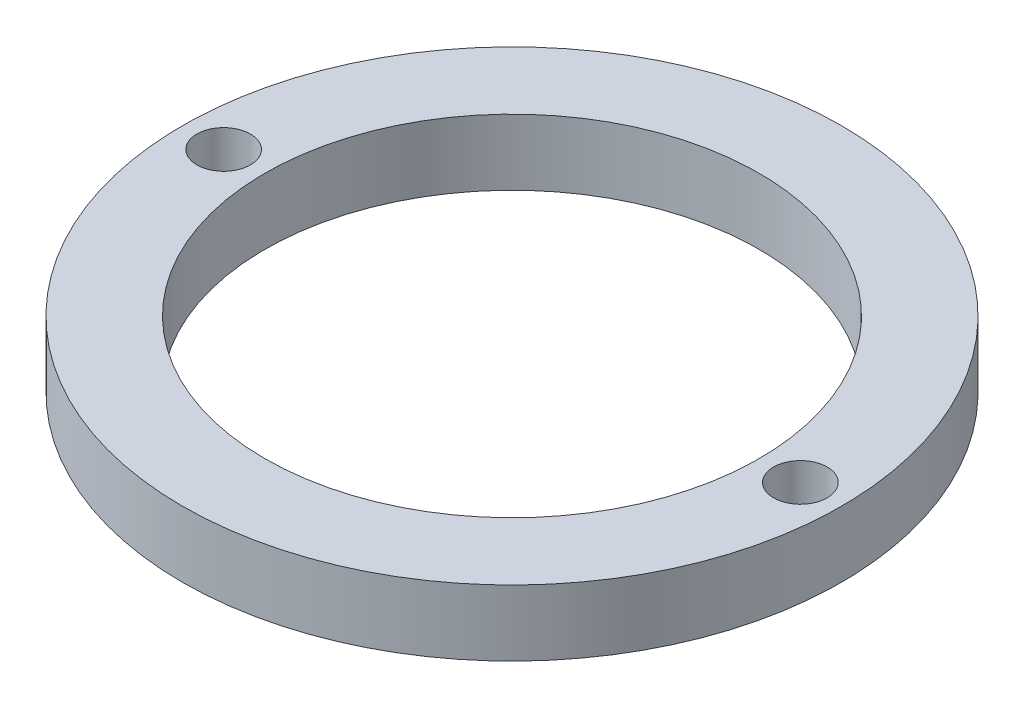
ISO-10303-21;
HEADER;
FILE_DESCRIPTION(('STEP AP214'),'2;1');
FILE_NAME('part.step','',(''),(''),'','','');
FILE_SCHEMA(('AUTOMOTIVE_DESIGN { 1 0 10303 214 1 1 1 1 }'));
ENDSEC;
DATA;
#1=APPLICATION_CONTEXT('core data for automotive mechanical design processes');
#2=APPLICATION_PROTOCOL_DEFINITION('international standard','automotive_design',2000,#1);
#3=PRODUCT_CONTEXT('',#1,'mechanical');
#4=PRODUCT('Part','Part','',(#3));
#5=PRODUCT_RELATED_PRODUCT_CATEGORY('part','',(#4));
#6=PRODUCT_DEFINITION_FORMATION('','',#4);
#7=PRODUCT_DEFINITION_CONTEXT('part definition',#1,'design');
#8=PRODUCT_DEFINITION('design','',#6,#7);
#9=PRODUCT_DEFINITION_SHAPE('','',#8);
#10=(LENGTH_UNIT() NAMED_UNIT(*) SI_UNIT(.MILLI.,.METRE.));
#11=(NAMED_UNIT(*) PLANE_ANGLE_UNIT() SI_UNIT($,.RADIAN.));
#12=(NAMED_UNIT(*) SI_UNIT($,.STERADIAN.) SOLID_ANGLE_UNIT());
#13=UNCERTAINTY_MEASURE_WITH_UNIT(LENGTH_MEASURE(1.E-05),#10,'distance_accuracy_value','');
#14=(GEOMETRIC_REPRESENTATION_CONTEXT(3) GLOBAL_UNCERTAINTY_ASSIGNED_CONTEXT((#13)) GLOBAL_UNIT_ASSIGNED_CONTEXT((#10,
#11,#12)) REPRESENTATION_CONTEXT('',''));
#15=CARTESIAN_POINT('',(0.,0.,0.));
#16=DIRECTION('',(0.,0.,1.));
#17=DIRECTION('',(1.,0.,0.));
#18=AXIS2_PLACEMENT_3D('',#15,#16,#17);
#19=CARTESIAN_POINT('',(0.,8.,0.));
#20=DIRECTION('',(0.,1.,0.));
#21=DIRECTION('',(0.,0.,1.));
#22=AXIS2_PLACEMENT_3D('',#19,#20,#21);
#23=PLANE('',#22);
#24=CARTESIAN_POINT('',(-35.,8.,0.));
#25=DIRECTION('',(0.,1.,0.));
#26=DIRECTION('',(0.,0.,1.));
#27=AXIS2_PLACEMENT_3D('',#24,#25,#26);
#28=CIRCLE('',#27,3.25);
#29=CARTESIAN_POINT('',(-35.,8.,3.25));
#30=VERTEX_POINT('',#29);
#31=EDGE_CURVE('E29',#30,#30,#28,.T.);
#32=ORIENTED_EDGE('',*,*,#31,.F.);
#33=EDGE_LOOP('',(#32));
#34=FACE_BOUND('',#33,.T.);
#35=CARTESIAN_POINT('',(0.,8.,0.));
#36=DIRECTION('',(0.,1.,0.));
#37=DIRECTION('',(0.,0.,1.));
#38=AXIS2_PLACEMENT_3D('',#35,#36,#37);
#39=CIRCLE('',#38,40.);
#40=CARTESIAN_POINT('',(0.,8.,40.));
#41=VERTEX_POINT('',#40);
#42=EDGE_CURVE('E8',#41,#41,#39,.T.);
#43=ORIENTED_EDGE('',*,*,#42,.T.);
#44=EDGE_LOOP('',(#43));
#45=FACE_BOUND('',#44,.T.);
#46=CARTESIAN_POINT('',(0.,8.,0.));
#47=DIRECTION('',(0.,1.,0.));
#48=DIRECTION('',(0.,0.,1.));
#49=AXIS2_PLACEMENT_3D('',#46,#47,#48);
#50=CIRCLE('',#49,30.);
#51=CARTESIAN_POINT('',(0.,8.,30.));
#52=VERTEX_POINT('',#51);
#53=EDGE_CURVE('E24',#52,#52,#50,.T.);
#54=ORIENTED_EDGE('',*,*,#53,.F.);
#55=EDGE_LOOP('',(#54));
#56=FACE_BOUND('',#55,.T.);
#57=CARTESIAN_POINT('',(35.,8.,0.));
#58=DIRECTION('',(0.,1.,0.));
#59=DIRECTION('',(0.,0.,1.));
#60=AXIS2_PLACEMENT_3D('',#57,#58,#59);
#61=CIRCLE('',#60,3.25);
#62=CARTESIAN_POINT('',(35.,8.,3.25));
#63=VERTEX_POINT('',#62);
#64=EDGE_CURVE('E35',#63,#63,#61,.T.);
#65=ORIENTED_EDGE('',*,*,#64,.F.);
#66=EDGE_LOOP('',(#65));
#67=FACE_BOUND('',#66,.T.);
#68=ADVANCED_FACE('F13',(#34,#45,#56,#67),#23,.T.);
#69=CARTESIAN_POINT('',(0.,0.,0.));
#70=DIRECTION('',(0.,1.,0.));
#71=DIRECTION('',(0.,0.,1.));
#72=AXIS2_PLACEMENT_3D('',#69,#70,#71);
#73=PLANE('',#72);
#74=CARTESIAN_POINT('',(0.,0.,0.));
#75=DIRECTION('',(0.,1.,0.));
#76=DIRECTION('',(0.,0.,1.));
#77=AXIS2_PLACEMENT_3D('',#74,#75,#76);
#78=CIRCLE('',#77,40.);
#79=CARTESIAN_POINT('',(0.,0.,40.));
#80=VERTEX_POINT('',#79);
#81=EDGE_CURVE('E17',#80,#80,#78,.T.);
#82=ORIENTED_EDGE('',*,*,#81,.F.);
#83=EDGE_LOOP('',(#82));
#84=FACE_BOUND('',#83,.T.);
#85=CARTESIAN_POINT('',(0.,0.,0.));
#86=DIRECTION('',(0.,1.,0.));
#87=DIRECTION('',(0.,0.,1.));
#88=AXIS2_PLACEMENT_3D('',#85,#86,#87);
#89=CIRCLE('',#88,30.);
#90=CARTESIAN_POINT('',(0.,0.,30.));
#91=VERTEX_POINT('',#90);
#92=EDGE_CURVE('E26',#91,#91,#89,.T.);
#93=ORIENTED_EDGE('',*,*,#92,.T.);
#94=EDGE_LOOP('',(#93));
#95=FACE_BOUND('',#94,.T.);
#96=CARTESIAN_POINT('',(-35.,0.,0.));
#97=DIRECTION('',(0.,1.,0.));
#98=DIRECTION('',(0.,0.,1.));
#99=AXIS2_PLACEMENT_3D('',#96,#97,#98);
#100=CIRCLE('',#99,3.25);
#101=CARTESIAN_POINT('',(-35.,0.,3.25));
#102=VERTEX_POINT('',#101);
#103=EDGE_CURVE('E32',#102,#102,#100,.T.);
#104=ORIENTED_EDGE('',*,*,#103,.T.);
#105=EDGE_LOOP('',(#104));
#106=FACE_BOUND('',#105,.T.);
#107=CARTESIAN_POINT('',(35.,0.,0.));
#108=DIRECTION('',(0.,1.,0.));
#109=DIRECTION('',(0.,0.,1.));
#110=AXIS2_PLACEMENT_3D('',#107,#108,#109);
#111=CIRCLE('',#110,3.25);
#112=CARTESIAN_POINT('',(35.,0.,3.25));
#113=VERTEX_POINT('',#112);
#114=EDGE_CURVE('E38',#113,#113,#111,.T.);
#115=ORIENTED_EDGE('',*,*,#114,.T.);
#116=EDGE_LOOP('',(#115));
#117=FACE_BOUND('',#116,.T.);
#118=ADVANCED_FACE('F48',(#84,#95,#106,#117),#73,.F.);
#119=CARTESIAN_POINT('',(0.,8.,0.));
#120=DIRECTION('',(0.,-1.,0.));
#121=DIRECTION('',(0.,0.,-1.));
#122=AXIS2_PLACEMENT_3D('',#119,#120,#121);
#123=CYLINDRICAL_SURFACE('',#122,40.);
#124=ORIENTED_EDGE('',*,*,#42,.F.);
#125=EDGE_LOOP('',(#124));
#126=FACE_BOUND('',#125,.T.);
#127=ORIENTED_EDGE('',*,*,#81,.T.);
#128=EDGE_LOOP('',(#127));
#129=FACE_BOUND('',#128,.T.);
#130=ADVANCED_FACE('F15',(#126,#129),#123,.T.);
#131=CARTESIAN_POINT('',(0.,8.,0.));
#132=DIRECTION('',(0.,-1.,0.));
#133=DIRECTION('',(0.,0.,-1.));
#134=AXIS2_PLACEMENT_3D('',#131,#132,#133);
#135=CYLINDRICAL_SURFACE('',#134,30.);
#136=ORIENTED_EDGE('',*,*,#53,.T.);
#137=EDGE_LOOP('',(#136));
#138=FACE_BOUND('',#137,.T.);
#139=ORIENTED_EDGE('',*,*,#92,.F.);
#140=EDGE_LOOP('',(#139));
#141=FACE_BOUND('',#140,.T.);
#142=ADVANCED_FACE('F59',(#138,#141),#135,.F.);
#143=CARTESIAN_POINT('',(-35.,8.,0.));
#144=DIRECTION('',(0.,-1.,0.));
#145=DIRECTION('',(0.,0.,-1.));
#146=AXIS2_PLACEMENT_3D('',#143,#144,#145);
#147=CYLINDRICAL_SURFACE('',#146,3.25);
#148=ORIENTED_EDGE('',*,*,#31,.T.);
#149=EDGE_LOOP('',(#148));
#150=FACE_BOUND('',#149,.T.);
#151=ORIENTED_EDGE('',*,*,#103,.F.);
#152=EDGE_LOOP('',(#151));
#153=FACE_BOUND('',#152,.T.);
#154=ADVANCED_FACE('F62',(#150,#153),#147,.F.);
#155=CARTESIAN_POINT('',(35.,8.,0.));
#156=DIRECTION('',(0.,-1.,0.));
#157=DIRECTION('',(0.,0.,-1.));
#158=AXIS2_PLACEMENT_3D('',#155,#156,#157);
#159=CYLINDRICAL_SURFACE('',#158,3.25);
#160=ORIENTED_EDGE('',*,*,#64,.T.);
#161=EDGE_LOOP('',(#160));
#162=FACE_BOUND('',#161,.T.);
#163=ORIENTED_EDGE('',*,*,#114,.F.);
#164=EDGE_LOOP('',(#163));
#165=FACE_BOUND('',#164,.T.);
#166=ADVANCED_FACE('F44',(#162,#165),#159,.F.);
#167=CLOSED_SHELL('',(#68,#118,#130,#142,#154,#166));
#168=MANIFOLD_SOLID_BREP('B1',#167);
#169=ADVANCED_BREP_SHAPE_REPRESENTATION('',(#18,#168),#14);
#170=SHAPE_DEFINITION_REPRESENTATION(#9,#169);
ENDSEC;
END-ISO-10303-21;
